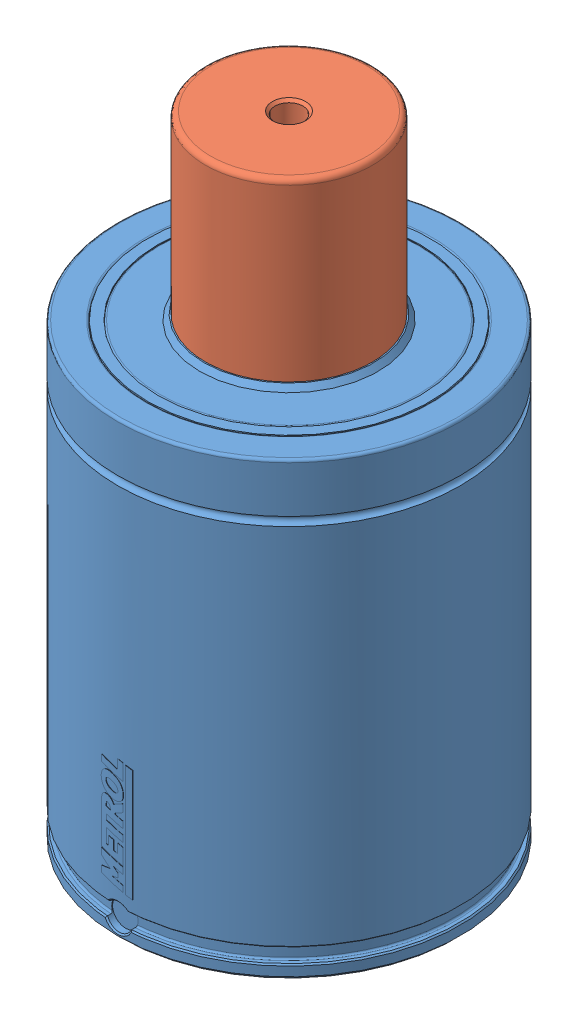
SolidWorks assembly ISNG10000-100.SLDASM, configuration Default (file format 7000). Lengths in mm.
Overall size (195 360 195.11).
2 component instances, 2 part files, 6 mates.
Components (placement in the parent):
- ISNG10000 Body-1: ISNG10000 Body.SLDPRT [ISNG10000-100] x (0 0 1) z (0 -1 0) size (195.11 195 260)
- ISNG10000 Piston-1: ISNG10000 Piston.SLDPRT [ISNG-10000-100] at (0 232 0) x (-1 0 0) z (0 -1 0) size (115 115 128)
Mates (geometry in assembly coordinates):
- Coincident1: coincident anti-aligned: plane of ISNG10000 Body-1 through (0 0 0) normal (0 -1 0); plane of assembly through (0 0 0) normal (0 1 0)
- Coincident2: coincident anti-aligned: plane of ISNG10000 Body-1; plane of assembly through (0 0 0) normal (1 0 0)
- Coincident3: coincident aligned: plane of ISNG10000 Body-1; plane of assembly through (0 0 0) normal (0 0 1)
- Concentric1: concentric aligned: cylinder of ISNG10000 Body-1 through (0 0 0) axis (0 -1 0) radius 47.5; cylinder of ISNG10000 Piston-1 through (0 232 0) axis (0 -1 0) radius 47.5
- Coincident4: coincident anti-aligned: plane of ISNG10000 Piston-1; plane of assembly through (0 0 0) normal (0 0 1)
- LimitDistance1: limit distance = 103 mm aligned: plane of ISNG10000 Body-1 through (-73.5 257 0) normal (0 1 0); plane of ISNG10000 Piston-1 through (0 360 -44.5) normal (0 1 0)
